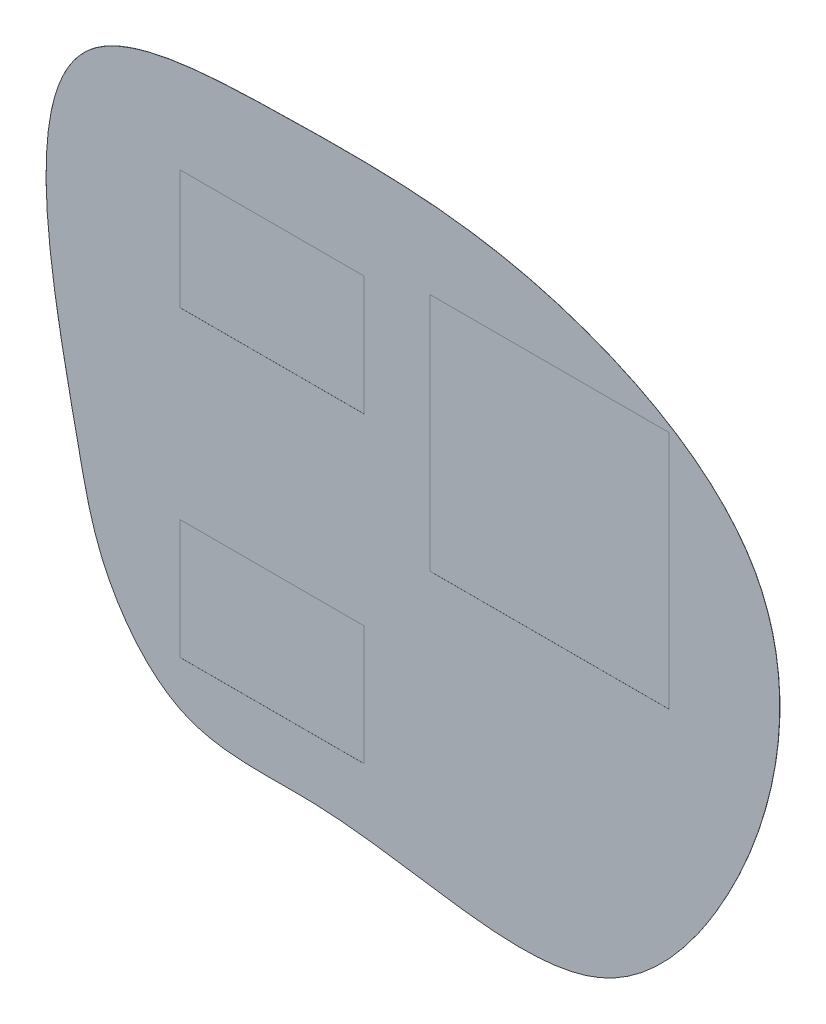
ISO-10303-21;
HEADER;
FILE_DESCRIPTION(('STEP AP214'),'2;1');
FILE_NAME('part.step','',(''),(''),'','','');
FILE_SCHEMA(('AUTOMOTIVE_DESIGN { 1 0 10303 214 1 1 1 1 }'));
ENDSEC;
DATA;
#1=APPLICATION_CONTEXT('core data for automotive mechanical design processes');
#2=APPLICATION_PROTOCOL_DEFINITION('international standard','automotive_design',2000,#1);
#3=PRODUCT_CONTEXT('',#1,'mechanical');
#4=PRODUCT('Part','Part','',(#3));
#5=PRODUCT_RELATED_PRODUCT_CATEGORY('part','',(#4));
#6=PRODUCT_DEFINITION_FORMATION('','',#4);
#7=PRODUCT_DEFINITION_CONTEXT('part definition',#1,'design');
#8=PRODUCT_DEFINITION('design','',#6,#7);
#9=PRODUCT_DEFINITION_SHAPE('','',#8);
#10=(LENGTH_UNIT() NAMED_UNIT(*) SI_UNIT(.MILLI.,.METRE.));
#11=(NAMED_UNIT(*) PLANE_ANGLE_UNIT() SI_UNIT($,.RADIAN.));
#12=(NAMED_UNIT(*) SI_UNIT($,.STERADIAN.) SOLID_ANGLE_UNIT());
#13=UNCERTAINTY_MEASURE_WITH_UNIT(LENGTH_MEASURE(1.E-05),#10,'distance_accuracy_value','');
#14=(GEOMETRIC_REPRESENTATION_CONTEXT(3) GLOBAL_UNCERTAINTY_ASSIGNED_CONTEXT((#13)) GLOBAL_UNIT_ASSIGNED_CONTEXT((#10,
#11,#12)) REPRESENTATION_CONTEXT('',''));
#15=CARTESIAN_POINT('',(0.,0.,0.));
#16=DIRECTION('',(0.,0.,1.));
#17=DIRECTION('',(1.,0.,0.));
#18=AXIS2_PLACEMENT_3D('',#15,#16,#17);
#19=CARTESIAN_POINT('',(1542.94756081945,-5058.38789309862,-2.));
#20=CARTESIAN_POINT('',(2567.67547790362,-3347.9302181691,-2.));
#21=CARTESIAN_POINT('',(3432.28099778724,524.462417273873,-2.));
#22=CARTESIAN_POINT('',(-1543.95614569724,3047.42923353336,-2.));
#23=CARTESIAN_POINT('',(-5225.46912140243,3046.11675523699,-2.));
#24=CARTESIAN_POINT('',(-10747.0105242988,2849.96186675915,-2.));
#25=CARTESIAN_POINT('',(-9568.18050631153,-2273.47842669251,-2.));
#26=CARTESIAN_POINT('',(-8971.48560604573,-5229.65041145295,-2.));
#27=CARTESIAN_POINT('',(-7626.76014276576,-7043.78559107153,-2.));
#28=CARTESIAN_POINT('',(-4371.4954275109,-6612.87987041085,-2.));
#29=CARTESIAN_POINT('',(-775.521263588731,-7962.4108639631,-2.));
#30=CARTESIAN_POINT('',(1029.48190666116,-5915.45566135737,-2.));
#31=CARTESIAN_POINT('',(1542.94756081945,-5058.38789309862,-2.));
#32=B_SPLINE_CURVE_WITH_KNOTS('',3,(#19,#20,#21,#22,#23,#24,#25,#26,#27,#28,#29,#30,#31),
.UNSPECIFIED.,.T.,.F.,(4,1,1,1,1,1,1,1,1,1,4),(0.,0.147519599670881,0.259691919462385,
0.385826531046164,0.472933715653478,0.634984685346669,0.675629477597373,0.731187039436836,
0.793920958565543,0.926081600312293,1.),.UNSPECIFIED.);
#33=DIRECTION('',(0.,0.,1.));
#34=VECTOR('',#33,1.);
#35=SURFACE_OF_LINEAR_EXTRUSION('',#32,#34);
#36=CARTESIAN_POINT('',(1542.94756081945,-5058.38789309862,-2.));
#37=VERTEX_POINT('',#36);
#38=EDGE_CURVE('E11',#37,#37,#32,.T.);
#39=ORIENTED_EDGE('',*,*,#38,.T.);
#40=EDGE_LOOP('',(#39));
#41=FACE_BOUND('',#40,.T.);
#42=CARTESIAN_POINT('',(1542.94756081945,-5058.38789309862,0.));
#43=CARTESIAN_POINT('',(2567.67547790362,-3347.9302181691,0.));
#44=CARTESIAN_POINT('',(3432.28099778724,524.462417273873,0.));
#45=CARTESIAN_POINT('',(-1543.95614569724,3047.42923353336,0.));
#46=CARTESIAN_POINT('',(-5225.46912140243,3046.11675523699,0.));
#47=CARTESIAN_POINT('',(-10747.0105242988,2849.96186675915,0.));
#48=CARTESIAN_POINT('',(-9568.18050631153,-2273.47842669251,0.));
#49=CARTESIAN_POINT('',(-8971.48560604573,-5229.65041145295,0.));
#50=CARTESIAN_POINT('',(-7626.76014276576,-7043.78559107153,0.));
#51=CARTESIAN_POINT('',(-4371.4954275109,-6612.87987041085,0.));
#52=CARTESIAN_POINT('',(-775.521263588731,-7962.4108639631,0.));
#53=CARTESIAN_POINT('',(1029.48190666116,-5915.45566135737,0.));
#54=CARTESIAN_POINT('',(1542.94756081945,-5058.38789309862,0.));
#55=B_SPLINE_CURVE_WITH_KNOTS('',3,(#42,#43,#44,#45,#46,#47,#48,#49,#50,#51,#52,#53,#54),
.UNSPECIFIED.,.T.,.F.,(4,1,1,1,1,1,1,1,1,1,4),(0.,0.147519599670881,0.259691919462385,
0.385826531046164,0.472933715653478,0.634984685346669,0.675629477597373,0.731187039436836,
0.793920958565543,0.926081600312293,1.),.UNSPECIFIED.);
#56=CARTESIAN_POINT('',(1542.94756081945,-5058.38789309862,0.));
#57=VERTEX_POINT('',#56);
#58=EDGE_CURVE('E35',#57,#57,#55,.T.);
#59=ORIENTED_EDGE('',*,*,#58,.F.);
#60=EDGE_LOOP('',(#59));
#61=FACE_BOUND('',#60,.T.);
#62=ADVANCED_FACE('F31',(#41,#61),#35,.T.);
#63=CARTESIAN_POINT('',(-9578.61780517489,1698.05363885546,-2.));
#64=DIRECTION('',(0.,0.,1.));
#65=DIRECTION('',(1.,0.,0.));
#66=AXIS2_PLACEMENT_3D('',#63,#64,#65);
#67=PLANE('',#66);
#68=ORIENTED_EDGE('',*,*,#38,.F.);
#69=EDGE_LOOP('',(#68));
#70=FACE_BOUND('',#69,.T.);
#71=ADVANCED_FACE('F257',(#70),#67,.F.);
#72=CARTESIAN_POINT('',(-9578.61780517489,1698.05363885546,0.));
#73=DIRECTION('',(0.,0.,1.));
#74=DIRECTION('',(1.,0.,0.));
#75=AXIS2_PLACEMENT_3D('',#72,#73,#74);
#76=PLANE('',#75);
#77=DIRECTION('',(0.,1.,0.));
#78=VECTOR('',#77,1.);
#79=CARTESIAN_POINT('',(751.257398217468,-2457.2074946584,0.));
#80=LINE('',#79,#78);
#81=CARTESIAN_POINT('',(751.257398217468,-2457.2074946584,0.));
#82=VERTEX_POINT('',#81);
#83=CARTESIAN_POINT('',(751.257398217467,1622.30607677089,0.));
#84=VERTEX_POINT('',#83);
#85=EDGE_CURVE('E47',#82,#84,#80,.T.);
#86=ORIENTED_EDGE('',*,*,#85,.F.);
#87=DIRECTION('',(1.,0.,0.));
#88=VECTOR('',#87,1.);
#89=CARTESIAN_POINT('',(751.257398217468,-2457.2074946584,0.));
#90=LINE('',#89,#88);
#91=CARTESIAN_POINT('',(-3319.0473389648,-2457.2074946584,0.));
#92=VERTEX_POINT('',#91);
#93=EDGE_CURVE('E141',#92,#82,#90,.T.);
#94=ORIENTED_EDGE('',*,*,#93,.F.);
#95=DIRECTION('',(0.,-1.,0.));
#96=VECTOR('',#95,1.);
#97=CARTESIAN_POINT('',(-3319.0473389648,-2457.2074946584,0.));
#98=LINE('',#97,#96);
#99=CARTESIAN_POINT('',(-3319.0473389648,1622.30607677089,0.));
#100=VERTEX_POINT('',#99);
#101=EDGE_CURVE('E144',#100,#92,#98,.T.);
#102=ORIENTED_EDGE('',*,*,#101,.F.);
#103=DIRECTION('',(-1.,0.,0.));
#104=VECTOR('',#103,1.);
#105=CARTESIAN_POINT('',(751.257398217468,1622.30607677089,0.));
#106=LINE('',#105,#104);
#107=EDGE_CURVE('E150',#84,#100,#106,.T.);
#108=ORIENTED_EDGE('',*,*,#107,.F.);
#109=EDGE_LOOP('',(#86,#94,#102,#108));
#110=FACE_BOUND('',#109,.T.);
#111=DIRECTION('',(0.,1.,0.));
#112=VECTOR('',#111,1.);
#113=CARTESIAN_POINT('',(-4440.87672032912,1333.22382845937,0.));
#114=LINE('',#113,#112);
#115=CARTESIAN_POINT('',(-4440.87672032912,-699.554848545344,0.));
#116=VERTEX_POINT('',#115);
#117=CARTESIAN_POINT('',(-4440.87672032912,1333.22382845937,0.));
#118=VERTEX_POINT('',#117);
#119=EDGE_CURVE('E55',#116,#118,#114,.T.);
#120=ORIENTED_EDGE('',*,*,#119,.F.);
#121=DIRECTION('',(1.,0.,0.));
#122=VECTOR('',#121,1.);
#123=CARTESIAN_POINT('',(-4440.87672032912,-699.554848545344,0.));
#124=LINE('',#123,#122);
#125=CARTESIAN_POINT('',(-7576.50129909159,-699.554848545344,0.));
#126=VERTEX_POINT('',#125);
#127=EDGE_CURVE('E163',#126,#116,#124,.T.);
#128=ORIENTED_EDGE('',*,*,#127,.F.);
#129=DIRECTION('',(0.,-1.,0.));
#130=VECTOR('',#129,1.);
#131=CARTESIAN_POINT('',(-7576.50129909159,1333.22382845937,0.));
#132=LINE('',#131,#130);
#133=CARTESIAN_POINT('',(-7576.50129909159,1333.22382845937,0.));
#134=VERTEX_POINT('',#133);
#135=EDGE_CURVE('E177',#134,#126,#132,.T.);
#136=ORIENTED_EDGE('',*,*,#135,.F.);
#137=DIRECTION('',(-1.,0.,0.));
#138=VECTOR('',#137,1.);
#139=CARTESIAN_POINT('',(-4440.87672032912,1333.22382845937,0.));
#140=LINE('',#139,#138);
#141=EDGE_CURVE('E174',#118,#134,#140,.T.);
#142=ORIENTED_EDGE('',*,*,#141,.F.);
#143=EDGE_LOOP('',(#120,#128,#136,#142));
#144=FACE_BOUND('',#143,.T.);
#145=DIRECTION('',(0.,1.,0.));
#146=VECTOR('',#145,1.);
#147=CARTESIAN_POINT('',(-4440.87672032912,-5856.14879477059,0.));
#148=LINE('',#147,#146);
#149=CARTESIAN_POINT('',(-4440.87672032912,-5856.14879477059,0.));
#150=VERTEX_POINT('',#149);
#151=CARTESIAN_POINT('',(-4440.87672032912,-3823.37011776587,0.));
#152=VERTEX_POINT('',#151);
#153=EDGE_CURVE('E184',#150,#152,#148,.T.);
#154=ORIENTED_EDGE('',*,*,#153,.F.);
#155=DIRECTION('',(1.,0.,0.));
#156=VECTOR('',#155,1.);
#157=CARTESIAN_POINT('',(-4440.87672032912,-5856.14879477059,0.));
#158=LINE('',#157,#156);
#159=CARTESIAN_POINT('',(-7576.50129909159,-5856.14879477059,0.));
#160=VERTEX_POINT('',#159);
#161=EDGE_CURVE('E194',#160,#150,#158,.T.);
#162=ORIENTED_EDGE('',*,*,#161,.F.);
#163=DIRECTION('',(0.,-1.,0.));
#164=VECTOR('',#163,1.);
#165=CARTESIAN_POINT('',(-7576.50129909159,-5856.14879477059,0.));
#166=LINE('',#165,#164);
#167=CARTESIAN_POINT('',(-7576.50129909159,-3823.37011776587,0.));
#168=VERTEX_POINT('',#167);
#169=EDGE_CURVE('E208',#168,#160,#166,.T.);
#170=ORIENTED_EDGE('',*,*,#169,.F.);
#171=DIRECTION('',(-1.,0.,0.));
#172=VECTOR('',#171,1.);
#173=CARTESIAN_POINT('',(-4440.87672032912,-3823.37011776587,0.));
#174=LINE('',#173,#172);
#175=EDGE_CURVE('E205',#152,#168,#174,.T.);
#176=ORIENTED_EDGE('',*,*,#175,.F.);
#177=EDGE_LOOP('',(#154,#162,#170,#176));
#178=FACE_BOUND('',#177,.T.);
#179=ORIENTED_EDGE('',*,*,#58,.T.);
#180=EDGE_LOOP('',(#179));
#181=FACE_BOUND('',#180,.T.);
#182=ADVANCED_FACE('F235',(#110,#144,#178,#181),#76,.T.);
#183=CARTESIAN_POINT('',(-4440.87672032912,-5856.14879477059,-1.));
#184=DIRECTION('',(1.,0.,0.));
#185=DIRECTION('',(0.,0.,-1.));
#186=AXIS2_PLACEMENT_3D('',#183,#184,#185);
#187=PLANE('',#186);
#188=ORIENTED_EDGE('',*,*,#153,.T.);
#189=DIRECTION('',(0.,0.,1.));
#190=VECTOR('',#189,1.);
#191=CARTESIAN_POINT('',(-4440.87672032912,-3823.37011776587,-1.));
#192=LINE('',#191,#190);
#193=CARTESIAN_POINT('',(-4440.87672032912,-3823.37011776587,-1.));
#194=VERTEX_POINT('',#193);
#195=EDGE_CURVE('E203',#194,#152,#192,.T.);
#196=ORIENTED_EDGE('',*,*,#195,.F.);
#197=DIRECTION('',(0.,1.,0.));
#198=VECTOR('',#197,1.);
#199=CARTESIAN_POINT('',(-4440.87672032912,-5856.14879477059,-1.));
#200=LINE('',#199,#198);
#201=CARTESIAN_POINT('',(-4440.87672032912,-5856.14879477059,-1.));
#202=VERTEX_POINT('',#201);
#203=EDGE_CURVE('E190',#202,#194,#200,.T.);
#204=ORIENTED_EDGE('',*,*,#203,.F.);
#205=DIRECTION('',(0.,0.,1.));
#206=VECTOR('',#205,1.);
#207=CARTESIAN_POINT('',(-4440.87672032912,-5856.14879477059,-1.));
#208=LINE('',#207,#206);
#209=EDGE_CURVE('E213',#202,#150,#208,.T.);
#210=ORIENTED_EDGE('',*,*,#209,.T.);
#211=EDGE_LOOP('',(#188,#196,#204,#210));
#212=FACE_BOUND('',#211,.T.);
#213=ADVANCED_FACE('F244',(#212),#187,.F.);
#214=CARTESIAN_POINT('',(-4440.87672032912,-5856.14879477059,-1.));
#215=DIRECTION('',(0.,-1.,0.));
#216=DIRECTION('',(0.,0.,-1.));
#217=AXIS2_PLACEMENT_3D('',#214,#215,#216);
#218=PLANE('',#217);
#219=ORIENTED_EDGE('',*,*,#161,.T.);
#220=ORIENTED_EDGE('',*,*,#209,.F.);
#221=DIRECTION('',(1.,0.,0.));
#222=VECTOR('',#221,1.);
#223=CARTESIAN_POINT('',(-4440.87672032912,-5856.14879477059,-1.));
#224=LINE('',#223,#222);
#225=CARTESIAN_POINT('',(-7576.50129909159,-5856.14879477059,-1.));
#226=VERTEX_POINT('',#225);
#227=EDGE_CURVE('E200',#226,#202,#224,.T.);
#228=ORIENTED_EDGE('',*,*,#227,.F.);
#229=DIRECTION('',(0.,0.,1.));
#230=VECTOR('',#229,1.);
#231=CARTESIAN_POINT('',(-7576.50129909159,-5856.14879477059,-1.));
#232=LINE('',#231,#230);
#233=EDGE_CURVE('E215',#226,#160,#232,.T.);
#234=ORIENTED_EDGE('',*,*,#233,.T.);
#235=EDGE_LOOP('',(#219,#220,#228,#234));
#236=FACE_BOUND('',#235,.T.);
#237=ADVANCED_FACE('F246',(#236),#218,.F.);
#238=CARTESIAN_POINT('',(-7576.50129909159,-5856.14879477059,-1.));
#239=DIRECTION('',(-1.,0.,0.));
#240=DIRECTION('',(0.,0.,1.));
#241=AXIS2_PLACEMENT_3D('',#238,#239,#240);
#242=PLANE('',#241);
#243=ORIENTED_EDGE('',*,*,#169,.T.);
#244=ORIENTED_EDGE('',*,*,#233,.F.);
#245=DIRECTION('',(0.,-1.,0.));
#246=VECTOR('',#245,1.);
#247=CARTESIAN_POINT('',(-7576.50129909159,-5856.14879477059,-1.));
#248=LINE('',#247,#246);
#249=CARTESIAN_POINT('',(-7576.50129909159,-3823.37011776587,-1.));
#250=VERTEX_POINT('',#249);
#251=EDGE_CURVE('E197',#250,#226,#248,.T.);
#252=ORIENTED_EDGE('',*,*,#251,.F.);
#253=DIRECTION('',(0.,0.,1.));
#254=VECTOR('',#253,1.);
#255=CARTESIAN_POINT('',(-7576.50129909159,-3823.37011776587,-1.));
#256=LINE('',#255,#254);
#257=EDGE_CURVE('E217',#250,#168,#256,.T.);
#258=ORIENTED_EDGE('',*,*,#257,.T.);
#259=EDGE_LOOP('',(#243,#244,#252,#258));
#260=FACE_BOUND('',#259,.T.);
#261=ADVANCED_FACE('F239',(#260),#242,.F.);
#262=CARTESIAN_POINT('',(-4440.87672032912,-3823.37011776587,-1.));
#263=DIRECTION('',(0.,1.,0.));
#264=DIRECTION('',(-1.,0.,0.));
#265=AXIS2_PLACEMENT_3D('',#262,#263,#264);
#266=PLANE('',#265);
#267=ORIENTED_EDGE('',*,*,#175,.T.);
#268=ORIENTED_EDGE('',*,*,#257,.F.);
#269=DIRECTION('',(-1.,0.,0.));
#270=VECTOR('',#269,1.);
#271=CARTESIAN_POINT('',(-4440.87672032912,-3823.37011776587,-1.));
#272=LINE('',#271,#270);
#273=EDGE_CURVE('E193',#194,#250,#272,.T.);
#274=ORIENTED_EDGE('',*,*,#273,.F.);
#275=ORIENTED_EDGE('',*,*,#195,.T.);
#276=EDGE_LOOP('',(#267,#268,#274,#275));
#277=FACE_BOUND('',#276,.T.);
#278=ADVANCED_FACE('F229',(#277),#266,.F.);
#279=CARTESIAN_POINT('',(-4440.87672032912,-3823.37011776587,-1.));
#280=DIRECTION('',(0.,0.,1.));
#281=DIRECTION('',(1.,0.,0.));
#282=AXIS2_PLACEMENT_3D('',#279,#280,#281);
#283=PLANE('',#282);
#284=ORIENTED_EDGE('',*,*,#203,.T.);
#285=ORIENTED_EDGE('',*,*,#273,.T.);
#286=ORIENTED_EDGE('',*,*,#251,.T.);
#287=ORIENTED_EDGE('',*,*,#227,.T.);
#288=EDGE_LOOP('',(#284,#285,#286,#287));
#289=FACE_BOUND('',#288,.T.);
#290=ADVANCED_FACE('F243',(#289),#283,.T.);
#291=CARTESIAN_POINT('',(-4440.87672032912,1333.22382845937,-1.));
#292=DIRECTION('',(1.,0.,0.));
#293=DIRECTION('',(0.,0.,-1.));
#294=AXIS2_PLACEMENT_3D('',#291,#292,#293);
#295=PLANE('',#294);
#296=ORIENTED_EDGE('',*,*,#119,.T.);
#297=DIRECTION('',(0.,0.,1.));
#298=VECTOR('',#297,1.);
#299=CARTESIAN_POINT('',(-4440.87672032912,1333.22382845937,-1.));
#300=LINE('',#299,#298);
#301=CARTESIAN_POINT('',(-4440.87672032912,1333.22382845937,-1.));
#302=VERTEX_POINT('',#301);
#303=EDGE_CURVE('E172',#302,#118,#300,.T.);
#304=ORIENTED_EDGE('',*,*,#303,.F.);
#305=DIRECTION('',(0.,1.,0.));
#306=VECTOR('',#305,1.);
#307=CARTESIAN_POINT('',(-4440.87672032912,1333.22382845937,-1.));
#308=LINE('',#307,#306);
#309=CARTESIAN_POINT('',(-4440.87672032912,-699.554848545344,-1.));
#310=VERTEX_POINT('',#309);
#311=EDGE_CURVE('E159',#310,#302,#308,.T.);
#312=ORIENTED_EDGE('',*,*,#311,.F.);
#313=DIRECTION('',(0.,0.,1.));
#314=VECTOR('',#313,1.);
#315=CARTESIAN_POINT('',(-4440.87672032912,-699.554848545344,-1.));
#316=LINE('',#315,#314);
#317=EDGE_CURVE('E182',#310,#116,#316,.T.);
#318=ORIENTED_EDGE('',*,*,#317,.T.);
#319=EDGE_LOOP('',(#296,#304,#312,#318));
#320=FACE_BOUND('',#319,.T.);
#321=ADVANCED_FACE('F278',(#320),#295,.F.);
#322=CARTESIAN_POINT('',(-4440.87672032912,-699.554848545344,-1.));
#323=DIRECTION('',(0.,-1.,0.));
#324=DIRECTION('',(0.,0.,-1.));
#325=AXIS2_PLACEMENT_3D('',#322,#323,#324);
#326=PLANE('',#325);
#327=ORIENTED_EDGE('',*,*,#127,.T.);
#328=ORIENTED_EDGE('',*,*,#317,.F.);
#329=DIRECTION('',(1.,0.,0.));
#330=VECTOR('',#329,1.);
#331=CARTESIAN_POINT('',(-4440.87672032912,-699.554848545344,-1.));
#332=LINE('',#331,#330);
#333=CARTESIAN_POINT('',(-7576.50129909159,-699.554848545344,-1.));
#334=VERTEX_POINT('',#333);
#335=EDGE_CURVE('E169',#334,#310,#332,.T.);
#336=ORIENTED_EDGE('',*,*,#335,.F.);
#337=DIRECTION('',(0.,0.,1.));
#338=VECTOR('',#337,1.);
#339=CARTESIAN_POINT('',(-7576.50129909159,-699.554848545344,-1.));
#340=LINE('',#339,#338);
#341=EDGE_CURVE('E185',#334,#126,#340,.T.);
#342=ORIENTED_EDGE('',*,*,#341,.T.);
#343=EDGE_LOOP('',(#327,#328,#336,#342));
#344=FACE_BOUND('',#343,.T.);
#345=ADVANCED_FACE('F282',(#344),#326,.F.);
#346=CARTESIAN_POINT('',(-7576.50129909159,1333.22382845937,-1.));
#347=DIRECTION('',(-1.,0.,0.));
#348=DIRECTION('',(0.,0.,1.));
#349=AXIS2_PLACEMENT_3D('',#346,#347,#348);
#350=PLANE('',#349);
#351=ORIENTED_EDGE('',*,*,#135,.T.);
#352=ORIENTED_EDGE('',*,*,#341,.F.);
#353=DIRECTION('',(0.,-1.,0.));
#354=VECTOR('',#353,1.);
#355=CARTESIAN_POINT('',(-7576.50129909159,1333.22382845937,-1.));
#356=LINE('',#355,#354);
#357=CARTESIAN_POINT('',(-7576.50129909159,1333.22382845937,-1.));
#358=VERTEX_POINT('',#357);
#359=EDGE_CURVE('E166',#358,#334,#356,.T.);
#360=ORIENTED_EDGE('',*,*,#359,.F.);
#361=DIRECTION('',(0.,0.,1.));
#362=VECTOR('',#361,1.);
#363=CARTESIAN_POINT('',(-7576.50129909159,1333.22382845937,-1.));
#364=LINE('',#363,#362);
#365=EDGE_CURVE('E187',#358,#134,#364,.T.);
#366=ORIENTED_EDGE('',*,*,#365,.T.);
#367=EDGE_LOOP('',(#351,#352,#360,#366));
#368=FACE_BOUND('',#367,.T.);
#369=ADVANCED_FACE('F289',(#368),#350,.F.);
#370=CARTESIAN_POINT('',(-4440.87672032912,1333.22382845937,-1.));
#371=DIRECTION('',(0.,1.,0.));
#372=DIRECTION('',(0.,0.,1.));
#373=AXIS2_PLACEMENT_3D('',#370,#371,#372);
#374=PLANE('',#373);
#375=ORIENTED_EDGE('',*,*,#141,.T.);
#376=ORIENTED_EDGE('',*,*,#365,.F.);
#377=DIRECTION('',(-1.,0.,0.));
#378=VECTOR('',#377,1.);
#379=CARTESIAN_POINT('',(-4440.87672032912,1333.22382845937,-1.));
#380=LINE('',#379,#378);
#381=EDGE_CURVE('E162',#302,#358,#380,.T.);
#382=ORIENTED_EDGE('',*,*,#381,.F.);
#383=ORIENTED_EDGE('',*,*,#303,.T.);
#384=EDGE_LOOP('',(#375,#376,#382,#383));
#385=FACE_BOUND('',#384,.T.);
#386=ADVANCED_FACE('F285',(#385),#374,.F.);
#387=CARTESIAN_POINT('',(-4440.87672032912,-699.554848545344,-1.));
#388=DIRECTION('',(0.,0.,-1.));
#389=DIRECTION('',(-1.,0.,0.));
#390=AXIS2_PLACEMENT_3D('',#387,#388,#389);
#391=PLANE('',#390);
#392=ORIENTED_EDGE('',*,*,#311,.T.);
#393=ORIENTED_EDGE('',*,*,#381,.T.);
#394=ORIENTED_EDGE('',*,*,#359,.T.);
#395=ORIENTED_EDGE('',*,*,#335,.T.);
#396=EDGE_LOOP('',(#392,#393,#394,#395));
#397=FACE_BOUND('',#396,.T.);
#398=ADVANCED_FACE('F288',(#397),#391,.F.);
#399=CARTESIAN_POINT('',(751.257398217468,-2457.2074946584,-1.));
#400=DIRECTION('',(1.,0.,0.));
#401=DIRECTION('',(0.,0.,-1.));
#402=AXIS2_PLACEMENT_3D('',#399,#400,#401);
#403=PLANE('',#402);
#404=ORIENTED_EDGE('',*,*,#85,.T.);
#405=DIRECTION('',(0.,0.,1.));
#406=VECTOR('',#405,1.);
#407=CARTESIAN_POINT('',(751.257398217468,1622.30607677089,-1.));
#408=LINE('',#407,#406);
#409=CARTESIAN_POINT('',(751.257398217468,1622.30607677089,-1.));
#410=VERTEX_POINT('',#409);
#411=EDGE_CURVE('E119',#410,#84,#408,.T.);
#412=ORIENTED_EDGE('',*,*,#411,.F.);
#413=DIRECTION('',(0.,1.,0.));
#414=VECTOR('',#413,1.);
#415=CARTESIAN_POINT('',(751.257398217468,-2457.2074946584,-1.));
#416=LINE('',#415,#414);
#417=CARTESIAN_POINT('',(751.257398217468,-2457.2074946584,-1.));
#418=VERTEX_POINT('',#417);
#419=EDGE_CURVE('E123',#418,#410,#416,.T.);
#420=ORIENTED_EDGE('',*,*,#419,.F.);
#421=DIRECTION('',(0.,0.,1.));
#422=VECTOR('',#421,1.);
#423=CARTESIAN_POINT('',(751.257398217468,-2457.2074946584,-1.));
#424=LINE('',#423,#422);
#425=EDGE_CURVE('E154',#418,#82,#424,.T.);
#426=ORIENTED_EDGE('',*,*,#425,.T.);
#427=EDGE_LOOP('',(#404,#412,#420,#426));
#428=FACE_BOUND('',#427,.T.);
#429=ADVANCED_FACE('F121',(#428),#403,.F.);
#430=CARTESIAN_POINT('',(751.257398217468,-2457.2074946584,-1.));
#431=DIRECTION('',(0.,-1.,0.));
#432=DIRECTION('',(1.,0.,0.));
#433=AXIS2_PLACEMENT_3D('',#430,#431,#432);
#434=PLANE('',#433);
#435=ORIENTED_EDGE('',*,*,#93,.T.);
#436=ORIENTED_EDGE('',*,*,#425,.F.);
#437=DIRECTION('',(1.,0.,0.));
#438=VECTOR('',#437,1.);
#439=CARTESIAN_POINT('',(751.257398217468,-2457.2074946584,-1.));
#440=LINE('',#439,#438);
#441=CARTESIAN_POINT('',(-3319.0473389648,-2457.2074946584,-1.));
#442=VERTEX_POINT('',#441);
#443=EDGE_CURVE('E129',#442,#418,#440,.T.);
#444=ORIENTED_EDGE('',*,*,#443,.F.);
#445=DIRECTION('',(0.,0.,1.));
#446=VECTOR('',#445,1.);
#447=CARTESIAN_POINT('',(-3319.0473389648,-2457.2074946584,-1.));
#448=LINE('',#447,#446);
#449=EDGE_CURVE('E156',#442,#92,#448,.T.);
#450=ORIENTED_EDGE('',*,*,#449,.T.);
#451=EDGE_LOOP('',(#435,#436,#444,#450));
#452=FACE_BOUND('',#451,.T.);
#453=ADVANCED_FACE('F302',(#452),#434,.F.);
#454=CARTESIAN_POINT('',(-3319.0473389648,-2457.2074946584,-1.));
#455=DIRECTION('',(-1.,0.,0.));
#456=DIRECTION('',(0.,0.,1.));
#457=AXIS2_PLACEMENT_3D('',#454,#455,#456);
#458=PLANE('',#457);
#459=ORIENTED_EDGE('',*,*,#101,.T.);
#460=ORIENTED_EDGE('',*,*,#449,.F.);
#461=DIRECTION('',(0.,-1.,0.));
#462=VECTOR('',#461,1.);
#463=CARTESIAN_POINT('',(-3319.0473389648,-2457.2074946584,-1.));
#464=LINE('',#463,#462);
#465=CARTESIAN_POINT('',(-3319.0473389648,1622.30607677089,-1.));
#466=VERTEX_POINT('',#465);
#467=EDGE_CURVE('E137',#466,#442,#464,.T.);
#468=ORIENTED_EDGE('',*,*,#467,.F.);
#469=DIRECTION('',(0.,0.,1.));
#470=VECTOR('',#469,1.);
#471=CARTESIAN_POINT('',(-3319.0473389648,1622.30607677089,-1.));
#472=LINE('',#471,#470);
#473=EDGE_CURVE('E128',#466,#100,#472,.T.);
#474=ORIENTED_EDGE('',*,*,#473,.T.);
#475=EDGE_LOOP('',(#459,#460,#468,#474));
#476=FACE_BOUND('',#475,.T.);
#477=ADVANCED_FACE('F305',(#476),#458,.F.);
#478=CARTESIAN_POINT('',(751.257398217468,1622.30607677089,-1.));
#479=DIRECTION('',(0.,1.,0.));
#480=DIRECTION('',(0.,0.,1.));
#481=AXIS2_PLACEMENT_3D('',#478,#479,#480);
#482=PLANE('',#481);
#483=ORIENTED_EDGE('',*,*,#107,.T.);
#484=ORIENTED_EDGE('',*,*,#473,.F.);
#485=DIRECTION('',(-1.,0.,0.));
#486=VECTOR('',#485,1.);
#487=CARTESIAN_POINT('',(751.257398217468,1622.30607677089,-1.));
#488=LINE('',#487,#486);
#489=EDGE_CURVE('E132',#410,#466,#488,.T.);
#490=ORIENTED_EDGE('',*,*,#489,.F.);
#491=ORIENTED_EDGE('',*,*,#411,.T.);
#492=EDGE_LOOP('',(#483,#484,#490,#491));
#493=FACE_BOUND('',#492,.T.);
#494=ADVANCED_FACE('F133',(#493),#482,.F.);
#495=CARTESIAN_POINT('',(751.257398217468,1622.30607677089,-1.));
#496=DIRECTION('',(0.,0.,1.));
#497=DIRECTION('',(1.,0.,0.));
#498=AXIS2_PLACEMENT_3D('',#495,#496,#497);
#499=PLANE('',#498);
#500=ORIENTED_EDGE('',*,*,#419,.T.);
#501=ORIENTED_EDGE('',*,*,#489,.T.);
#502=ORIENTED_EDGE('',*,*,#467,.T.);
#503=ORIENTED_EDGE('',*,*,#443,.T.);
#504=EDGE_LOOP('',(#500,#501,#502,#503));
#505=FACE_BOUND('',#504,.T.);
#506=ADVANCED_FACE('F139',(#505),#499,.T.);
#507=CLOSED_SHELL('',(#62,#71,#182,#213,#237,#261,#278,#290,#321,#345,#369,#386,#398,#429,#453,
#477,#494,#506));
#508=MANIFOLD_SOLID_BREP('B2',#507);
#509=ADVANCED_BREP_SHAPE_REPRESENTATION('',(#18,#508),#14);
#510=SHAPE_DEFINITION_REPRESENTATION(#9,#509);
ENDSEC;
END-ISO-10303-21;
